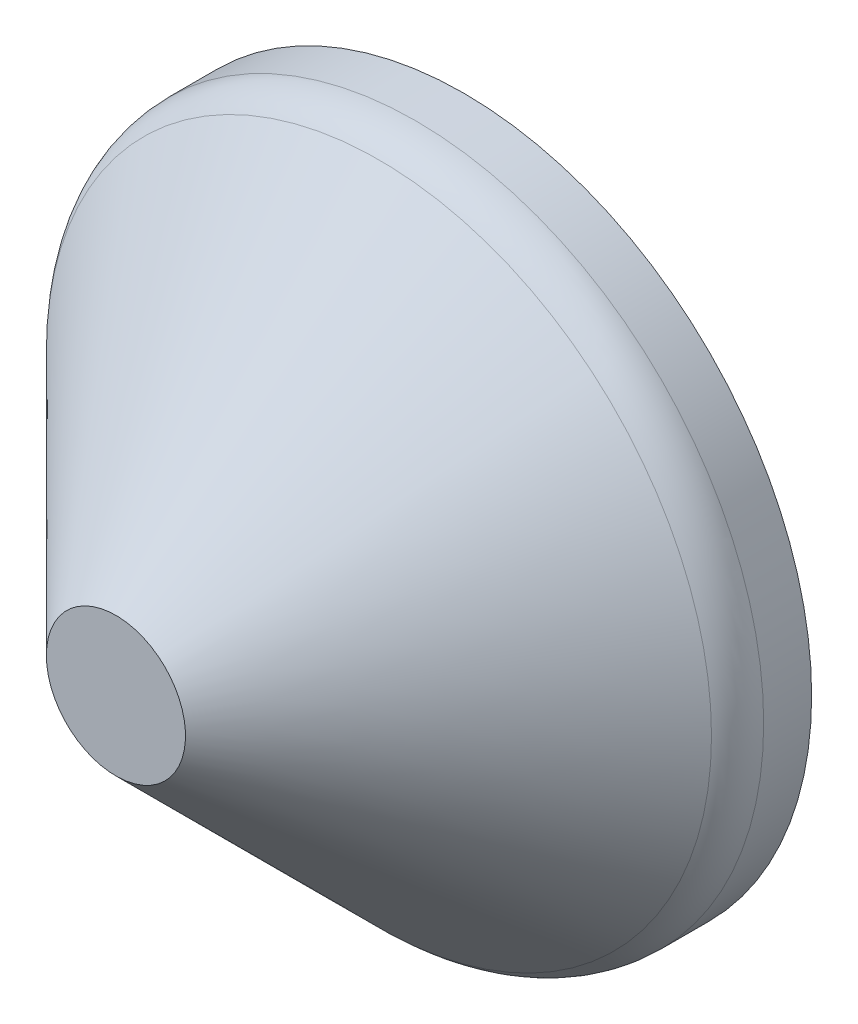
from build123d import *

# Parameters (mm, degrees)
FILLET1_R = 38.1
SHELL1_T  = -25.4


with BuildPart() as part:
    # Sketch1 → Revolve1 (revolve)
    with BuildSketch(Plane(origin=(0, 0, 0), x_dir=(1, 0, 0), z_dir=(0, 1, 0))):
        Polygon((0, 0), (254, 0), (254, -50.8), (50.8, -254), (0, -254), align=None)
    revolve(axis=Axis((0, 0, 254), (0, 0, -1)))

    # Fillet1
    fillet1_edges = [part.edges().sort_by_distance(p)[0] for p in [
        (-254, 0, 50.8),
    ]]
    fillet(fillet1_edges, radius=FILLET1_R)

    # Shell1
    shell1_openings = [part.faces().sort_by_distance(p)[0] for p in [
        (0, 0, 0),
    ]]
    offset(amount=SHELL1_T, openings=shell1_openings, kind=Kind.INTERSECTION)


solid = part.part
